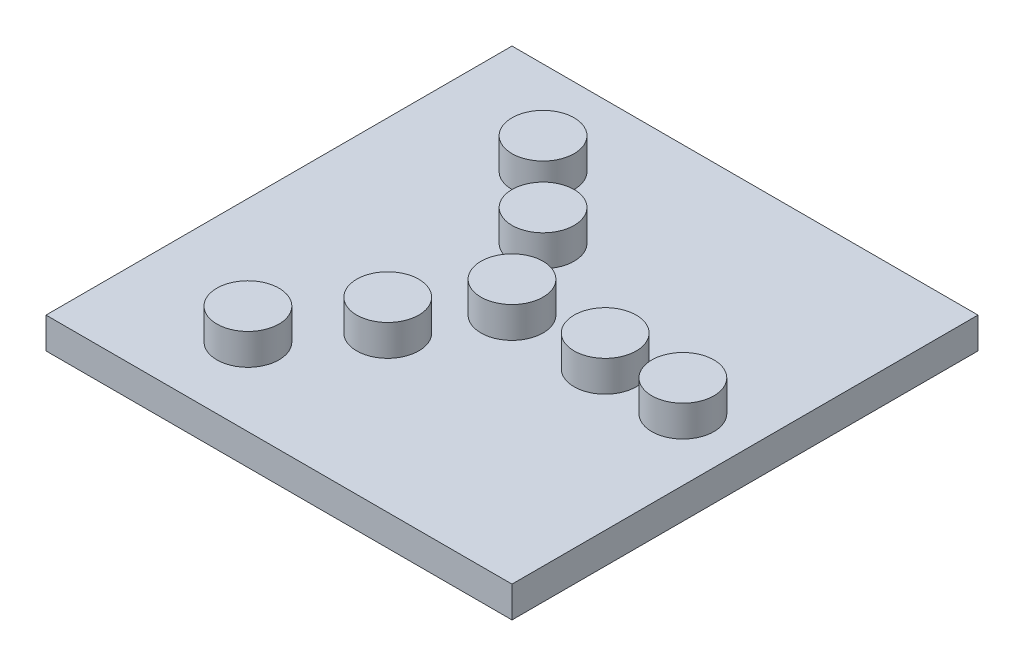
ISO-10303-21;
HEADER;
FILE_DESCRIPTION(('STEP AP214'),'2;1');
FILE_NAME('part.step','',(''),(''),'','','');
FILE_SCHEMA(('AUTOMOTIVE_DESIGN { 1 0 10303 214 1 1 1 1 }'));
ENDSEC;
DATA;
#1=APPLICATION_CONTEXT('core data for automotive mechanical design processes');
#2=APPLICATION_PROTOCOL_DEFINITION('international standard','automotive_design',2000,#1);
#3=PRODUCT_CONTEXT('',#1,'mechanical');
#4=PRODUCT('Part','Part','',(#3));
#5=PRODUCT_RELATED_PRODUCT_CATEGORY('part','',(#4));
#6=PRODUCT_DEFINITION_FORMATION('','',#4);
#7=PRODUCT_DEFINITION_CONTEXT('part definition',#1,'design');
#8=PRODUCT_DEFINITION('design','',#6,#7);
#9=PRODUCT_DEFINITION_SHAPE('','',#8);
#10=(LENGTH_UNIT() NAMED_UNIT(*) SI_UNIT(.MILLI.,.METRE.));
#11=(NAMED_UNIT(*) PLANE_ANGLE_UNIT() SI_UNIT($,.RADIAN.));
#12=(NAMED_UNIT(*) SI_UNIT($,.STERADIAN.) SOLID_ANGLE_UNIT());
#13=UNCERTAINTY_MEASURE_WITH_UNIT(LENGTH_MEASURE(1.E-05),#10,'distance_accuracy_value','');
#14=(GEOMETRIC_REPRESENTATION_CONTEXT(3) GLOBAL_UNCERTAINTY_ASSIGNED_CONTEXT((#13)) GLOBAL_UNIT_ASSIGNED_CONTEXT((#10,
#11,#12)) REPRESENTATION_CONTEXT('',''));
#15=CARTESIAN_POINT('',(0.,0.,0.));
#16=DIRECTION('',(0.,0.,1.));
#17=DIRECTION('',(1.,0.,0.));
#18=AXIS2_PLACEMENT_3D('',#15,#16,#17);
#19=CARTESIAN_POINT('',(0.,10.,-150.));
#20=DIRECTION('',(0.,1.,0.));
#21=DIRECTION('',(0.,0.,1.));
#22=AXIS2_PLACEMENT_3D('',#19,#20,#21);
#23=PLANE('',#22);
#24=CARTESIAN_POINT('',(105.,10.,-75.));
#25=DIRECTION('',(0.,1.,0.));
#26=DIRECTION('',(0.,0.,1.));
#27=AXIS2_PLACEMENT_3D('',#24,#25,#26);
#28=CIRCLE('',#27,9.99999999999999);
#29=CARTESIAN_POINT('',(105.,10.,-65.));
#30=VERTEX_POINT('',#29);
#31=EDGE_CURVE('E135',#30,#30,#28,.T.);
#32=ORIENTED_EDGE('',*,*,#31,.F.);
#33=EDGE_LOOP('',(#32));
#34=FACE_BOUND('',#33,.T.);
#35=CARTESIAN_POINT('',(60.,10.,-100.));
#36=DIRECTION('',(0.,1.,0.));
#37=DIRECTION('',(0.,0.,1.));
#38=AXIS2_PLACEMENT_3D('',#35,#36,#37);
#39=CIRCLE('',#38,9.99999999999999);
#40=CARTESIAN_POINT('',(60.,10.,-90.));
#41=VERTEX_POINT('',#40);
#42=EDGE_CURVE('E147',#41,#41,#39,.T.);
#43=ORIENTED_EDGE('',*,*,#42,.F.);
#44=EDGE_LOOP('',(#43));
#45=FACE_BOUND('',#44,.T.);
#46=CARTESIAN_POINT('',(40.,10.,-25.));
#47=DIRECTION('',(0.,1.,0.));
#48=DIRECTION('',(0.,0.,1.));
#49=AXIS2_PLACEMENT_3D('',#46,#47,#48);
#50=CIRCLE('',#49,9.99999999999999);
#51=CARTESIAN_POINT('',(40.,10.,-15.));
#52=VERTEX_POINT('',#51);
#53=EDGE_CURVE('E157',#52,#52,#50,.T.);
#54=ORIENTED_EDGE('',*,*,#53,.F.);
#55=EDGE_LOOP('',(#54));
#56=FACE_BOUND('',#55,.T.);
#57=DIRECTION('',(-1.,0.,0.));
#58=VECTOR('',#57,1.);
#59=CARTESIAN_POINT('',(150.,10.,-150.));
#60=LINE('',#59,#58);
#61=CARTESIAN_POINT('',(150.,10.,-150.));
#62=VERTEX_POINT('',#61);
#63=CARTESIAN_POINT('',(0.,10.,-150.));
#64=VERTEX_POINT('',#63);
#65=EDGE_CURVE('E101',#62,#64,#60,.T.);
#66=ORIENTED_EDGE('',*,*,#65,.T.);
#67=DIRECTION('',(0.,0.,1.));
#68=VECTOR('',#67,1.);
#69=CARTESIAN_POINT('',(0.,10.,-150.));
#70=LINE('',#69,#68);
#71=CARTESIAN_POINT('',(0.,10.,0.));
#72=VERTEX_POINT('',#71);
#73=EDGE_CURVE('E86',#64,#72,#70,.T.);
#74=ORIENTED_EDGE('',*,*,#73,.T.);
#75=DIRECTION('',(1.,0.,0.));
#76=VECTOR('',#75,1.);
#77=CARTESIAN_POINT('',(0.,10.,0.));
#78=LINE('',#77,#76);
#79=CARTESIAN_POINT('',(150.,10.,0.));
#80=VERTEX_POINT('',#79);
#81=EDGE_CURVE('E53',#72,#80,#78,.T.);
#82=ORIENTED_EDGE('',*,*,#81,.T.);
#83=DIRECTION('',(0.,0.,-1.));
#84=VECTOR('',#83,1.);
#85=CARTESIAN_POINT('',(150.,10.,0.));
#86=LINE('',#85,#84);
#87=EDGE_CURVE('E48',#80,#62,#86,.T.);
#88=ORIENTED_EDGE('',*,*,#87,.T.);
#89=EDGE_LOOP('',(#66,#74,#82,#88));
#90=FACE_BOUND('',#89,.T.);
#91=CARTESIAN_POINT('',(75.,10.,-75.));
#92=DIRECTION('',(0.,1.,0.));
#93=DIRECTION('',(0.,0.,1.));
#94=AXIS2_PLACEMENT_3D('',#91,#92,#93);
#95=CIRCLE('',#94,9.99999999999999);
#96=CARTESIAN_POINT('',(75.,10.,-65.));
#97=VERTEX_POINT('',#96);
#98=EDGE_CURVE('E94',#97,#97,#95,.T.);
#99=ORIENTED_EDGE('',*,*,#98,.F.);
#100=EDGE_LOOP('',(#99));
#101=FACE_BOUND('',#100,.T.);
#102=CARTESIAN_POINT('',(60.,10.,-50.));
#103=DIRECTION('',(0.,1.,0.));
#104=DIRECTION('',(0.,0.,1.));
#105=AXIS2_PLACEMENT_3D('',#102,#103,#104);
#106=CIRCLE('',#105,9.99999999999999);
#107=CARTESIAN_POINT('',(60.,10.,-40.));
#108=VERTEX_POINT('',#107);
#109=EDGE_CURVE('E123',#108,#108,#106,.T.);
#110=ORIENTED_EDGE('',*,*,#109,.F.);
#111=EDGE_LOOP('',(#110));
#112=FACE_BOUND('',#111,.T.);
#113=CARTESIAN_POINT('',(40.,10.,-120.));
#114=DIRECTION('',(0.,1.,0.));
#115=DIRECTION('',(0.,0.,1.));
#116=AXIS2_PLACEMENT_3D('',#113,#114,#115);
#117=CIRCLE('',#116,9.99999999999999);
#118=CARTESIAN_POINT('',(40.,10.,-110.));
#119=VERTEX_POINT('',#118);
#120=EDGE_CURVE('E127',#119,#119,#117,.T.);
#121=ORIENTED_EDGE('',*,*,#120,.F.);
#122=EDGE_LOOP('',(#121));
#123=FACE_BOUND('',#122,.T.);
#124=CARTESIAN_POINT('',(130.,10.,-75.));
#125=DIRECTION('',(0.,1.,0.));
#126=DIRECTION('',(0.,0.,1.));
#127=AXIS2_PLACEMENT_3D('',#124,#125,#126);
#128=CIRCLE('',#127,9.99999999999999);
#129=CARTESIAN_POINT('',(130.,10.,-65.));
#130=VERTEX_POINT('',#129);
#131=EDGE_CURVE('E130',#130,#130,#128,.T.);
#132=ORIENTED_EDGE('',*,*,#131,.F.);
#133=EDGE_LOOP('',(#132));
#134=FACE_BOUND('',#133,.T.);
#135=ADVANCED_FACE('F33',(#34,#45,#56,#90,#101,#112,#123,#134),#23,.T.);
#136=CARTESIAN_POINT('',(150.,10.,-150.));
#137=DIRECTION('',(0.,0.,1.));
#138=DIRECTION('',(1.,0.,0.));
#139=AXIS2_PLACEMENT_3D('',#136,#137,#138);
#140=PLANE('',#139);
#141=DIRECTION('',(-1.,0.,0.));
#142=VECTOR('',#141,1.);
#143=CARTESIAN_POINT('',(150.,0.,-150.));
#144=LINE('',#143,#142);
#145=CARTESIAN_POINT('',(150.,0.,-150.));
#146=VERTEX_POINT('',#145);
#147=CARTESIAN_POINT('',(0.,0.,-150.));
#148=VERTEX_POINT('',#147);
#149=EDGE_CURVE('E78',#146,#148,#144,.T.);
#150=ORIENTED_EDGE('',*,*,#149,.T.);
#151=DIRECTION('',(0.,-1.,0.));
#152=VECTOR('',#151,1.);
#153=CARTESIAN_POINT('',(0.,10.,-150.));
#154=LINE('',#153,#152);
#155=EDGE_CURVE('E11',#64,#148,#154,.T.);
#156=ORIENTED_EDGE('',*,*,#155,.F.);
#157=ORIENTED_EDGE('',*,*,#65,.F.);
#158=DIRECTION('',(0.,-1.,0.));
#159=VECTOR('',#158,1.);
#160=CARTESIAN_POINT('',(150.,10.,-150.));
#161=LINE('',#160,#159);
#162=EDGE_CURVE('E90',#62,#146,#161,.T.);
#163=ORIENTED_EDGE('',*,*,#162,.T.);
#164=EDGE_LOOP('',(#150,#156,#157,#163));
#165=FACE_BOUND('',#164,.T.);
#166=ADVANCED_FACE('F35',(#165),#140,.F.);
#167=CARTESIAN_POINT('',(0.,10.,-150.));
#168=DIRECTION('',(1.,0.,0.));
#169=DIRECTION('',(0.,0.,-1.));
#170=AXIS2_PLACEMENT_3D('',#167,#168,#169);
#171=PLANE('',#170);
#172=DIRECTION('',(0.,0.,1.));
#173=VECTOR('',#172,1.);
#174=CARTESIAN_POINT('',(0.,0.,-150.));
#175=LINE('',#174,#173);
#176=CARTESIAN_POINT('',(0.,0.,0.));
#177=VERTEX_POINT('',#176);
#178=EDGE_CURVE('E74',#148,#177,#175,.T.);
#179=ORIENTED_EDGE('',*,*,#178,.T.);
#180=DIRECTION('',(0.,-1.,0.));
#181=VECTOR('',#180,1.);
#182=CARTESIAN_POINT('',(0.,10.,0.));
#183=LINE('',#182,#181);
#184=EDGE_CURVE('E41',#72,#177,#183,.T.);
#185=ORIENTED_EDGE('',*,*,#184,.F.);
#186=ORIENTED_EDGE('',*,*,#73,.F.);
#187=ORIENTED_EDGE('',*,*,#155,.T.);
#188=EDGE_LOOP('',(#179,#185,#186,#187));
#189=FACE_BOUND('',#188,.T.);
#190=ADVANCED_FACE('F85',(#189),#171,.F.);
#191=CARTESIAN_POINT('',(0.,10.,0.));
#192=DIRECTION('',(0.,0.,-1.));
#193=DIRECTION('',(-1.,0.,0.));
#194=AXIS2_PLACEMENT_3D('',#191,#192,#193);
#195=PLANE('',#194);
#196=DIRECTION('',(1.,0.,0.));
#197=VECTOR('',#196,1.);
#198=CARTESIAN_POINT('',(0.,0.,0.));
#199=LINE('',#198,#197);
#200=CARTESIAN_POINT('',(150.,0.,0.));
#201=VERTEX_POINT('',#200);
#202=EDGE_CURVE('E79',#177,#201,#199,.T.);
#203=ORIENTED_EDGE('',*,*,#202,.T.);
#204=DIRECTION('',(0.,-1.,0.));
#205=VECTOR('',#204,1.);
#206=CARTESIAN_POINT('',(150.,10.,0.));
#207=LINE('',#206,#205);
#208=EDGE_CURVE('E107',#80,#201,#207,.T.);
#209=ORIENTED_EDGE('',*,*,#208,.F.);
#210=ORIENTED_EDGE('',*,*,#81,.F.);
#211=ORIENTED_EDGE('',*,*,#184,.T.);
#212=EDGE_LOOP('',(#203,#209,#210,#211));
#213=FACE_BOUND('',#212,.T.);
#214=ADVANCED_FACE('F110',(#213),#195,.F.);
#215=CARTESIAN_POINT('',(150.,10.,0.));
#216=DIRECTION('',(-1.,0.,0.));
#217=DIRECTION('',(0.,0.,1.));
#218=AXIS2_PLACEMENT_3D('',#215,#216,#217);
#219=PLANE('',#218);
#220=DIRECTION('',(0.,0.,-1.));
#221=VECTOR('',#220,1.);
#222=CARTESIAN_POINT('',(150.,0.,0.));
#223=LINE('',#222,#221);
#224=EDGE_CURVE('E99',#201,#146,#223,.T.);
#225=ORIENTED_EDGE('',*,*,#224,.T.);
#226=ORIENTED_EDGE('',*,*,#162,.F.);
#227=ORIENTED_EDGE('',*,*,#87,.F.);
#228=ORIENTED_EDGE('',*,*,#208,.T.);
#229=EDGE_LOOP('',(#225,#226,#227,#228));
#230=FACE_BOUND('',#229,.T.);
#231=ADVANCED_FACE('F112',(#230),#219,.F.);
#232=CARTESIAN_POINT('',(0.,0.,-150.));
#233=DIRECTION('',(0.,1.,0.));
#234=DIRECTION('',(0.,0.,1.));
#235=AXIS2_PLACEMENT_3D('',#232,#233,#234);
#236=PLANE('',#235);
#237=ORIENTED_EDGE('',*,*,#149,.F.);
#238=ORIENTED_EDGE('',*,*,#224,.F.);
#239=ORIENTED_EDGE('',*,*,#202,.F.);
#240=ORIENTED_EDGE('',*,*,#178,.F.);
#241=EDGE_LOOP('',(#237,#238,#239,#240));
#242=FACE_BOUND('',#241,.T.);
#243=ADVANCED_FACE('F75',(#242),#236,.F.);
#244=CARTESIAN_POINT('',(75.,20.,-75.));
#245=DIRECTION('',(0.,-1.,0.));
#246=DIRECTION('',(0.,0.,-1.));
#247=AXIS2_PLACEMENT_3D('',#244,#245,#246);
#248=CYLINDRICAL_SURFACE('',#247,9.99999999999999);
#249=CARTESIAN_POINT('',(75.,20.,-75.));
#250=DIRECTION('',(0.,1.,0.));
#251=DIRECTION('',(0.,0.,1.));
#252=AXIS2_PLACEMENT_3D('',#249,#250,#251);
#253=CIRCLE('',#252,9.99999999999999);
#254=CARTESIAN_POINT('',(75.,20.,-65.));
#255=VERTEX_POINT('',#254);
#256=EDGE_CURVE('E91',#255,#255,#253,.T.);
#257=ORIENTED_EDGE('',*,*,#256,.F.);
#258=EDGE_LOOP('',(#257));
#259=FACE_BOUND('',#258,.T.);
#260=ORIENTED_EDGE('',*,*,#98,.T.);
#261=EDGE_LOOP('',(#260));
#262=FACE_BOUND('',#261,.T.);
#263=ADVANCED_FACE('F163',(#259,#262),#248,.T.);
#264=CARTESIAN_POINT('',(75.,20.,-75.));
#265=DIRECTION('',(0.,1.,0.));
#266=DIRECTION('',(0.,0.,1.));
#267=AXIS2_PLACEMENT_3D('',#264,#265,#266);
#268=PLANE('',#267);
#269=ORIENTED_EDGE('',*,*,#256,.T.);
#270=EDGE_LOOP('',(#269));
#271=FACE_BOUND('',#270,.T.);
#272=ADVANCED_FACE('F165',(#271),#268,.T.);
#273=CARTESIAN_POINT('',(40.,20.,-25.));
#274=DIRECTION('',(0.,-1.,0.));
#275=DIRECTION('',(0.,0.,-1.));
#276=AXIS2_PLACEMENT_3D('',#273,#274,#275);
#277=CYLINDRICAL_SURFACE('',#276,9.99999999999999);
#278=CARTESIAN_POINT('',(40.,20.,-25.));
#279=DIRECTION('',(0.,1.,0.));
#280=DIRECTION('',(0.,0.,1.));
#281=AXIS2_PLACEMENT_3D('',#278,#279,#280);
#282=CIRCLE('',#281,9.99999999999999);
#283=CARTESIAN_POINT('',(40.,20.,-15.));
#284=VERTEX_POINT('',#283);
#285=EDGE_CURVE('E160',#284,#284,#282,.T.);
#286=ORIENTED_EDGE('',*,*,#285,.F.);
#287=EDGE_LOOP('',(#286));
#288=FACE_BOUND('',#287,.T.);
#289=ORIENTED_EDGE('',*,*,#53,.T.);
#290=EDGE_LOOP('',(#289));
#291=FACE_BOUND('',#290,.T.);
#292=ADVANCED_FACE('F172',(#288,#291),#277,.T.);
#293=CARTESIAN_POINT('',(40.,20.,-25.));
#294=DIRECTION('',(0.,1.,0.));
#295=DIRECTION('',(0.,0.,1.));
#296=AXIS2_PLACEMENT_3D('',#293,#294,#295);
#297=PLANE('',#296);
#298=ORIENTED_EDGE('',*,*,#285,.T.);
#299=EDGE_LOOP('',(#298));
#300=FACE_BOUND('',#299,.T.);
#301=ADVANCED_FACE('F204',(#300),#297,.T.);
#302=CARTESIAN_POINT('',(60.,20.,-50.));
#303=DIRECTION('',(0.,-1.,0.));
#304=DIRECTION('',(0.,0.,-1.));
#305=AXIS2_PLACEMENT_3D('',#302,#303,#304);
#306=CYLINDRICAL_SURFACE('',#305,9.99999999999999);
#307=CARTESIAN_POINT('',(60.,20.,-50.));
#308=DIRECTION('',(0.,1.,0.));
#309=DIRECTION('',(0.,0.,1.));
#310=AXIS2_PLACEMENT_3D('',#307,#308,#309);
#311=CIRCLE('',#310,9.99999999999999);
#312=CARTESIAN_POINT('',(60.,20.,-40.));
#313=VERTEX_POINT('',#312);
#314=EDGE_CURVE('E154',#313,#313,#311,.T.);
#315=ORIENTED_EDGE('',*,*,#314,.F.);
#316=EDGE_LOOP('',(#315));
#317=FACE_BOUND('',#316,.T.);
#318=ORIENTED_EDGE('',*,*,#109,.T.);
#319=EDGE_LOOP('',(#318));
#320=FACE_BOUND('',#319,.T.);
#321=ADVANCED_FACE('F213',(#317,#320),#306,.T.);
#322=CARTESIAN_POINT('',(60.,20.,-50.));
#323=DIRECTION('',(0.,1.,0.));
#324=DIRECTION('',(0.,0.,1.));
#325=AXIS2_PLACEMENT_3D('',#322,#323,#324);
#326=PLANE('',#325);
#327=ORIENTED_EDGE('',*,*,#314,.T.);
#328=EDGE_LOOP('',(#327));
#329=FACE_BOUND('',#328,.T.);
#330=ADVANCED_FACE('F223',(#329),#326,.T.);
#331=CARTESIAN_POINT('',(60.,20.,-100.));
#332=DIRECTION('',(0.,-1.,0.));
#333=DIRECTION('',(0.,0.,-1.));
#334=AXIS2_PLACEMENT_3D('',#331,#332,#333);
#335=CYLINDRICAL_SURFACE('',#334,9.99999999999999);
#336=CARTESIAN_POINT('',(60.,20.,-100.));
#337=DIRECTION('',(0.,1.,0.));
#338=DIRECTION('',(0.,0.,1.));
#339=AXIS2_PLACEMENT_3D('',#336,#337,#338);
#340=CIRCLE('',#339,9.99999999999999);
#341=CARTESIAN_POINT('',(60.,20.,-90.));
#342=VERTEX_POINT('',#341);
#343=EDGE_CURVE('E150',#342,#342,#340,.T.);
#344=ORIENTED_EDGE('',*,*,#343,.F.);
#345=EDGE_LOOP('',(#344));
#346=FACE_BOUND('',#345,.T.);
#347=ORIENTED_EDGE('',*,*,#42,.T.);
#348=EDGE_LOOP('',(#347));
#349=FACE_BOUND('',#348,.T.);
#350=ADVANCED_FACE('F233',(#346,#349),#335,.T.);
#351=CARTESIAN_POINT('',(60.,20.,-100.));
#352=DIRECTION('',(0.,1.,0.));
#353=DIRECTION('',(0.,0.,1.));
#354=AXIS2_PLACEMENT_3D('',#351,#352,#353);
#355=PLANE('',#354);
#356=ORIENTED_EDGE('',*,*,#343,.T.);
#357=EDGE_LOOP('',(#356));
#358=FACE_BOUND('',#357,.T.);
#359=ADVANCED_FACE('F243',(#358),#355,.T.);
#360=CARTESIAN_POINT('',(40.,20.,-120.));
#361=DIRECTION('',(0.,-1.,0.));
#362=DIRECTION('',(0.,0.,-1.));
#363=AXIS2_PLACEMENT_3D('',#360,#361,#362);
#364=CYLINDRICAL_SURFACE('',#363,9.99999999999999);
#365=CARTESIAN_POINT('',(40.,20.,-120.));
#366=DIRECTION('',(0.,1.,0.));
#367=DIRECTION('',(0.,0.,1.));
#368=AXIS2_PLACEMENT_3D('',#365,#366,#367);
#369=CIRCLE('',#368,9.99999999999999);
#370=CARTESIAN_POINT('',(40.,20.,-110.));
#371=VERTEX_POINT('',#370);
#372=EDGE_CURVE('E144',#371,#371,#369,.T.);
#373=ORIENTED_EDGE('',*,*,#372,.F.);
#374=EDGE_LOOP('',(#373));
#375=FACE_BOUND('',#374,.T.);
#376=ORIENTED_EDGE('',*,*,#120,.T.);
#377=EDGE_LOOP('',(#376));
#378=FACE_BOUND('',#377,.T.);
#379=ADVANCED_FACE('F253',(#375,#378),#364,.T.);
#380=CARTESIAN_POINT('',(40.,20.,-120.));
#381=DIRECTION('',(0.,1.,0.));
#382=DIRECTION('',(0.,0.,1.));
#383=AXIS2_PLACEMENT_3D('',#380,#381,#382);
#384=PLANE('',#383);
#385=ORIENTED_EDGE('',*,*,#372,.T.);
#386=EDGE_LOOP('',(#385));
#387=FACE_BOUND('',#386,.T.);
#388=ADVANCED_FACE('F263',(#387),#384,.T.);
#389=CARTESIAN_POINT('',(105.,20.,-75.));
#390=DIRECTION('',(0.,-1.,0.));
#391=DIRECTION('',(0.,0.,-1.));
#392=AXIS2_PLACEMENT_3D('',#389,#390,#391);
#393=CYLINDRICAL_SURFACE('',#392,9.99999999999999);
#394=CARTESIAN_POINT('',(105.,20.,-75.));
#395=DIRECTION('',(0.,1.,0.));
#396=DIRECTION('',(0.,0.,1.));
#397=AXIS2_PLACEMENT_3D('',#394,#395,#396);
#398=CIRCLE('',#397,9.99999999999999);
#399=CARTESIAN_POINT('',(105.,20.,-65.));
#400=VERTEX_POINT('',#399);
#401=EDGE_CURVE('E140',#400,#400,#398,.T.);
#402=ORIENTED_EDGE('',*,*,#401,.F.);
#403=EDGE_LOOP('',(#402));
#404=FACE_BOUND('',#403,.T.);
#405=ORIENTED_EDGE('',*,*,#31,.T.);
#406=EDGE_LOOP('',(#405));
#407=FACE_BOUND('',#406,.T.);
#408=ADVANCED_FACE('F273',(#404,#407),#393,.T.);
#409=CARTESIAN_POINT('',(105.,20.,-75.));
#410=DIRECTION('',(0.,1.,0.));
#411=DIRECTION('',(0.,0.,1.));
#412=AXIS2_PLACEMENT_3D('',#409,#410,#411);
#413=PLANE('',#412);
#414=ORIENTED_EDGE('',*,*,#401,.T.);
#415=EDGE_LOOP('',(#414));
#416=FACE_BOUND('',#415,.T.);
#417=ADVANCED_FACE('F283',(#416),#413,.T.);
#418=CARTESIAN_POINT('',(130.,20.,-75.));
#419=DIRECTION('',(0.,-1.,0.));
#420=DIRECTION('',(0.,0.,-1.));
#421=AXIS2_PLACEMENT_3D('',#418,#419,#420);
#422=CYLINDRICAL_SURFACE('',#421,9.99999999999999);
#423=CARTESIAN_POINT('',(130.,20.,-75.));
#424=DIRECTION('',(0.,1.,0.));
#425=DIRECTION('',(0.,0.,1.));
#426=AXIS2_PLACEMENT_3D('',#423,#424,#425);
#427=CIRCLE('',#426,9.99999999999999);
#428=CARTESIAN_POINT('',(130.,20.,-65.));
#429=VERTEX_POINT('',#428);
#430=EDGE_CURVE('E132',#429,#429,#427,.T.);
#431=ORIENTED_EDGE('',*,*,#430,.F.);
#432=EDGE_LOOP('',(#431));
#433=FACE_BOUND('',#432,.T.);
#434=ORIENTED_EDGE('',*,*,#131,.T.);
#435=EDGE_LOOP('',(#434));
#436=FACE_BOUND('',#435,.T.);
#437=ADVANCED_FACE('F293',(#433,#436),#422,.T.);
#438=CARTESIAN_POINT('',(130.,20.,-75.));
#439=DIRECTION('',(0.,1.,0.));
#440=DIRECTION('',(0.,0.,1.));
#441=AXIS2_PLACEMENT_3D('',#438,#439,#440);
#442=PLANE('',#441);
#443=ORIENTED_EDGE('',*,*,#430,.T.);
#444=EDGE_LOOP('',(#443));
#445=FACE_BOUND('',#444,.T.);
#446=ADVANCED_FACE('F303',(#445),#442,.T.);
#447=CLOSED_SHELL('',(#135,#166,#190,#214,#231,#243,#263,#272,#292,#301,#321,#330,#350,#359,
#379,#388,#408,#417,#437,#446));
#448=MANIFOLD_SOLID_BREP('B2',#447);
#449=ADVANCED_BREP_SHAPE_REPRESENTATION('',(#18,#448),#14);
#450=SHAPE_DEFINITION_REPRESENTATION(#9,#449);
ENDSEC;
END-ISO-10303-21;
